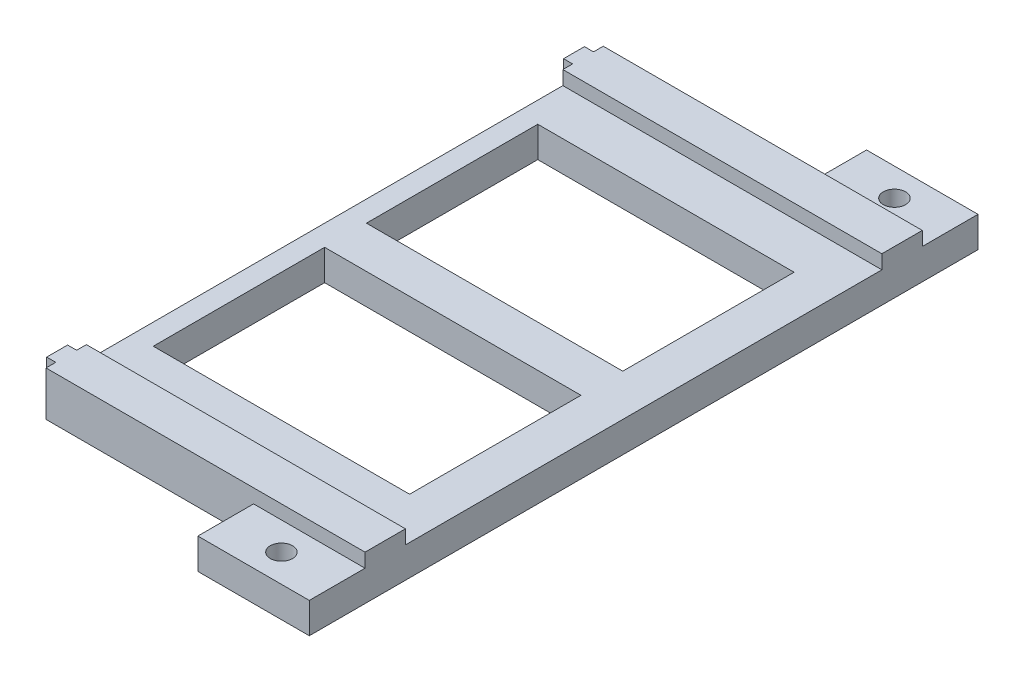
from build123d import *

# Parameters (mm, degrees)
SKETCH1_W                = 369
SKETCH1_H                = 200
BOSS_EXTRUDE1_DEPTH      = 16
SKETCH2_W                = 129
SKETCH2_H                = 16
BOSS_EXTRUDE2_DEPTH      = 12
SKETCH3_W                = 342
SKETCH3_H                = 168
CUT_EXTRUDE1_DEPTH       = 5
SKETCH4_W                = 100
SKETCH4_H                = 12
BOSS_EXTRUDE3_DEPTH      = 60
BOSS_EXTRUDE5_DEPTH      = 42
EXTRUDE_THIN1_DEPTH      = 7
SKETCH11_W               = 140
SKETCH11_H               = 200
CUT_EXTRUDE5_DEPTH       = 255.047731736
BOSS_EXTRUDE6_DEPTH      = 28
FILLET1_R                = 1.5
CUT_EXTRUDE6_DEPTH       = 246.813445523
CUT_EXTRUDE6_DEPTH_BACK  = 246.813445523
SKETCH14_W               = 151.600397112
SKETCH14_H               = 12
SKETCH15_W               = 97.865977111
SKETCH15_H               = 16
BOSS_EXTRUDE7_DEPTH      = 62
SKETCH16_W               = 97.865977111
SKETCH16_H               = 13
BOSS_EXTRUDE8_DEPTH      = 20
SKETCH17_W               = 97.865977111
SKETCH17_H               = 5.65
BOSS_EXTRUDE9_DEPTH      = 5
FILLET3_R                = 1
SKETCH18_W               = 12
SKETCH18_H               = 168
CUT_EXTRUDE7_DEPTH       = 5
SKETCH19_W               = 40
SKETCH19_H               = 11
BOSS_EXTRUDE10_DEPTH     = 20
SKETCH20_R               = 4
CUT_EXTRUDE8_DEPTH       = 231.063578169
FILLET3_OF_MIRROR3_R     = 1
SKETCH21_W               = 92
SKETCH21_H               = 61.5
CUT_EXTRUDE9_DEPTH       = 231.063578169
SKETCH22_W               = 1.5
SKETCH22_H               = 54
CUT_EXTRUDE10_DEPTH      = 195.970552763
CUT_EXTRUDE11_REACH      = 235.504
SKETCH23_W               = 13.223192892
SKETCH23_H               = 36
CUT_EXTRUDE12_DEPTH      = 234.504282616
CUT_EXTRUDE12_DEPTH_BACK = 234.504282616
SKETCH24_W               = 122.5
SKETCH24_H               = 245.404844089
SKETCH25_W               = 3.25
SKETCH25_H               = 7.5
BOSS_EXTRUDE11_DEPTH     = 16


with BuildPart() as part:
    # Sketch1 → Boss-Extrude1 (new body)
    with BuildSketch(Plane(origin=(0, 0, 0), x_dir=(1, 0, 0), z_dir=(0, 1, 0))):
        Rectangle(SKETCH1_W, SKETCH1_H)
    extrude(amount=BOSS_EXTRUDE1_DEPTH)

    # Sketch2 → Boss-Extrude2 (add)
    with BuildSketch(Plane(origin=(0, 16, 0), x_dir=(1, 0, 0), z_dir=(0, 1, 0))):
        Polygon((-184.5, -100), (-155.616556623, -100), (-119.5, -100), (-119.5, -84), (-169.5, -84), (-169.5, -36.5), (-184.5, -36.5), align=None)
        Polygon((-184.5, 100), (-155.616556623, 100), (-119.5, 100), (-119.5, 84), (-169.5, 84), (-169.5, 36.5), (-184.5, 36.5), align=None)
        with Locations((20, -92)):
            Rectangle(SKETCH2_W, SKETCH2_H)
        with Locations((20, 92)):
            Rectangle(SKETCH2_W, SKETCH2_H)
    extrude(amount=BOSS_EXTRUDE2_DEPTH)

    # Sketch3 → Cut-Extrude1 (cut)
    with BuildSketch(Plane(origin=(0, 16, 0), x_dir=(1, 0, 0), z_dir=(0, 1, 0))):
        with Locations((1.5, 0)):
            Rectangle(SKETCH3_W, SKETCH3_H)
    extrude(amount=-CUT_EXTRUDE1_DEPTH, mode=Mode.SUBTRACT)

    # Sketch4 → Boss-Extrude3 (add)
    with BuildSketch(Plane(origin=(0, 0, -100), x_dir=(-1, 0, 0), z_dir=(0, 0, -1))):
        with Locations((-19.5, 22)):
            Rectangle(SKETCH4_W, SKETCH4_H)
    extrude(amount=BOSS_EXTRUDE3_DEPTH)

    # Sketch8 → Boss-Extrude5 (add)
    with BuildSketch(Plane(origin=(0, 28, 0), x_dir=(1, 0, 0), z_dir=(0, 1, 0))):
        Polygon((-184.5, 36.5), (-169.5, 36.5), (-169.5, 84), (-119.5, 84), (-119.5, 100), (-184.5, 100), align=None)
    extrude(amount=BOSS_EXTRUDE5_DEPTH)

    # Sketch9 → Extrude-Thin1 (add)
    with BuildSketch(Plane(origin=(0, 70, 0), x_dir=(1, 0, 0), z_dir=(0, 1, 0))):
        Polygon((-119.5, 84), (-119.5, 70), (-155.5, 70), (-155.5, 35), (-169.5, 35), (-169.5, 45), (-165.5, 45), (-165.5, 80), (-129.5, 80), (-129.5, 84), align=None)
    extrude(amount=-EXTRUDE_THIN1_DEPTH)

    # Sketch11 → Cut-Extrude5 (cut, through all)
    with BuildSketch(Plane(origin=(0, 70, 0), x_dir=(1, 0, 0), z_dir=(0, 1, 0))):
        with Locations((-114.5, 0)):
            Rectangle(SKETCH11_W, SKETCH11_H)
    extrude(amount=-CUT_EXTRUDE5_DEPTH, mode=Mode.SUBTRACT)

    # Sketch13 → Boss-Extrude6 (add, through all)
    with BuildSketch(Plane(origin=(0, 28, 0), x_dir=(1, 0, 0), z_dir=(0, 1, 0))):
        Polygon((-44.5, 96.22), (-44.5, 87.78), (-52.3, 86.40464955), (-52.3, 97.59535045), align=None)
        Polygon((-44.5, -87.78), (-44.5, -96.22), (-52.5, -97.630615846), (-52.5, -86.369384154), align=None)
    extrude(amount=-BOSS_EXTRUDE6_DEPTH)

    # Fillet1
    fillet1_edges = [part.edges().sort_by_distance(p)[0] for p in [
        (-52.3, 14, -97.59535045),
        (-44.5, 14, -96.22),
        (-44.5, 14, -87.78),
        (-52.3, 14, -86.40464955),
        (-52.5, 14, 86.369384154),
        (-44.5, 14, 87.78),
        (-44.5, 14, 96.22),
        (-52.5, 14, 97.630615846),
    ]]
    fillet(fillet1_edges, radius=FILLET1_R)

    # Sketch14 → Cut-Extrude6 (cut, two sides: drawn at the far end of the back side and taken through both)
    with BuildSketch(Plane.XY.offset(-CUT_EXTRUDE6_DEPTH_BACK)):
        with Locations((8.699801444, 22)):
            Rectangle(SKETCH14_W, SKETCH14_H)
    extrude(amount=CUT_EXTRUDE6_DEPTH + CUT_EXTRUDE6_DEPTH_BACK, mode=Mode.SUBTRACT)

    # Sketch15 → Boss-Extrude7 (add)
    with BuildSketch(Plane(origin=(0, 16, 0), x_dir=(1, 0, 0), z_dir=(0, 1, 0))):
        with Locations((30.966091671, 92)):
            Rectangle(SKETCH15_W, SKETCH15_H)
    boss_extrude7 = extrude(amount=BOSS_EXTRUDE7_DEPTH)

    # Sketch16 → Boss-Extrude8 (add)
    with BuildSketch(Plane.XY.offset(-84)):
        with Locations((30.966091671, 71.5)):
            Rectangle(SKETCH16_W, SKETCH16_H)
    boss_extrude8 = extrude(amount=BOSS_EXTRUDE8_DEPTH)

    # Sketch17 → Boss-Extrude9 (add)
    with BuildSketch(Plane.XZ.offset(-65)):
        with Locations((30.966091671, -74.025)):
            Rectangle(SKETCH17_W, SKETCH17_H)
    boss_extrude9 = extrude(amount=BOSS_EXTRUDE9_DEPTH)

    # Fillet3
    fillet3_edges = [part.edges().sort_by_distance(p)[0] for p in [
        (30.96609167, 60, -76.85),
        (30.96609167, 60, -71.2),
    ]]
    fillet(fillet3_edges, radius=FILLET3_R)

    # Sketch18 → Cut-Extrude7 (cut)
    with BuildSketch(Plane(origin=(0, 16, 0), x_dir=(1, 0, 0), z_dir=(0, 1, 0))):
        with Locations((178.5, 0)):
            Rectangle(SKETCH18_W, SKETCH18_H)
    extrude(amount=-CUT_EXTRUDE7_DEPTH, mode=Mode.SUBTRACT)

    # Sketch19 → Boss-Extrude10 (add)
    with BuildSketch(Plane(origin=(0, 0, -100), x_dir=(-1, 0, 0), z_dir=(0, 0, -1))):
        with Locations((-20, 5.5)):
            Rectangle(SKETCH19_W, SKETCH19_H)
        with Locations((-164.5, 5.5)):
            Rectangle(SKETCH19_W, SKETCH19_H)
    boss_extrude10 = extrude(amount=BOSS_EXTRUDE10_DEPTH)

    # Sketch20 → Cut-Extrude8 (cut, through all)
    with BuildSketch(Plane(origin=(0, 11, 0), x_dir=(1, 0, 0), z_dir=(0, 1, 0))):
        with Locations(Location((164.5, 110, 0), (0, 0, 270))):
            Circle(SKETCH20_R)
        with Locations(Location((20, 110, 0), (0, 0, 270))):
            Circle(SKETCH20_R)
    cut_extrude8 = extrude(amount=-CUT_EXTRUDE8_DEPTH, mode=Mode.SUBTRACT)

    # Mirror3: Boss-Extrude7, Boss-Extrude8, Boss-Extrude9, Boss-Extrude10, Cut-Extrude8 across plane
    add(boss_extrude7.mirror(Plane.XY))
    add(boss_extrude8.mirror(Plane.XY))
    add(boss_extrude9.mirror(Plane.XY))
    add(boss_extrude10.mirror(Plane.XY))
    add(cut_extrude8.mirror(Plane.XY), mode=Mode.SUBTRACT)

    # Fillet3 of Mirror3
    fillet3_of_mirror3_edges = [part.edges().sort_by_distance(p)[0] for p in [
        (30.96609167, 60, 76.85),
        (30.96609167, 60, 71.2),
    ]]
    fillet(fillet3_of_mirror3_edges, radius=FILLET3_OF_MIRROR3_R)

    # Sketch21 → Cut-Extrude9 (cut, through all)
    with BuildSketch(Plane(origin=(0, 11, 0), x_dir=(1, 0, 0), z_dir=(0, 1, 0))):
        with Locations((16.5, 38.25)):
            Rectangle(SKETCH21_W, SKETCH21_H)
        with Locations((123.5, 38.25)):
            Rectangle(SKETCH21_W, SKETCH21_H)
        with Locations((16.5, -38.25)):
            Rectangle(SKETCH21_W, SKETCH21_H)
        with Locations((123.5, -38.25)):
            Rectangle(SKETCH21_W, SKETCH21_H)
    extrude(amount=-CUT_EXTRUDE9_DEPTH, mode=Mode.SUBTRACT)

    # Sketch22 → Cut-Extrude10 (cut, symmetric)
    with BuildSketch(Plane(origin=(79.899080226, 0, 0), x_dir=(0, 0, -1), z_dir=(1, 0, 0))):
        with Locations((-84.75, 38)):
            Rectangle(SKETCH22_W, SKETCH22_H)
    cut_extrude10 = extrude(amount=CUT_EXTRUDE10_DEPTH, both=True, mode=Mode.SUBTRACT)

    # Mirror4: Cut-Extrude10 across plane
    add(cut_extrude10.mirror(Plane.XY), mode=Mode.SUBTRACT)

    # Cut-Extrude11: up to this face of the body (flat: up to its plane)
    cut_extrude11_end = Plane(part.part.faces().sort_by_distance((132.199540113, 16, -92.75))[0])
    # Sketch23 → Cut-Extrude11 (cut, up to the picked face)
    with BuildSketch(Plane(origin=(0, 78, 0), x_dir=(1, 0, 0), z_dir=(0, 1, 0)), mode=Mode.PRIVATE) as cut_extrude11_sk1:
        with Locations((73.28748378, -82)):
            Rectangle(SKETCH23_W, SKETCH23_H)
    cut_extrude11_tool1 = split(extrude(cut_extrude11_sk1.sketch, amount=-CUT_EXTRUDE11_REACH, mode=Mode.PRIVATE), bisect_by=cut_extrude11_end, keep=Keep.BOTH, mode=Mode.PRIVATE)
    cut_extrude11 = cut_extrude11_tool1.solids().sort_by(Axis((73.287484, 78, 82), (0, -1, 0)))[0]
    add(cut_extrude11, mode=Mode.SUBTRACT)

    # Mirror5: Cut-Extrude11 across plane
    add(cut_extrude11.mirror(Plane.XY), mode=Mode.SUBTRACT)

    # Sketch24 → Cut-Extrude12 (cut, two sides: drawn at the far end of the back side and taken through both)
    with BuildSketch(Plane(origin=(0, 78, 0), x_dir=(1, 0, 0), z_dir=(0, 1, 0)).offset(-CUT_EXTRUDE12_DEPTH_BACK)):
        with Locations((8.75, 0.680734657)):
            Rectangle(SKETCH24_W, SKETCH24_H)
    extrude(amount=CUT_EXTRUDE12_DEPTH + CUT_EXTRUDE12_DEPTH_BACK, mode=Mode.SUBTRACT)

    # Sketch25 → Boss-Extrude11 (add)
    with BuildSketch(Plane(origin=(0, 16, 0), x_dir=(1, 0, 0), z_dir=(0, 1, 0))):
        with Locations((68.375, -92.75)):
            Rectangle(SKETCH25_W, SKETCH25_H)
    boss_extrude11 = extrude(amount=-BOSS_EXTRUDE11_DEPTH)

    # Mirror6: Boss-Extrude11 across plane
    add(boss_extrude11.mirror(Plane.XY))


solid = part.part
